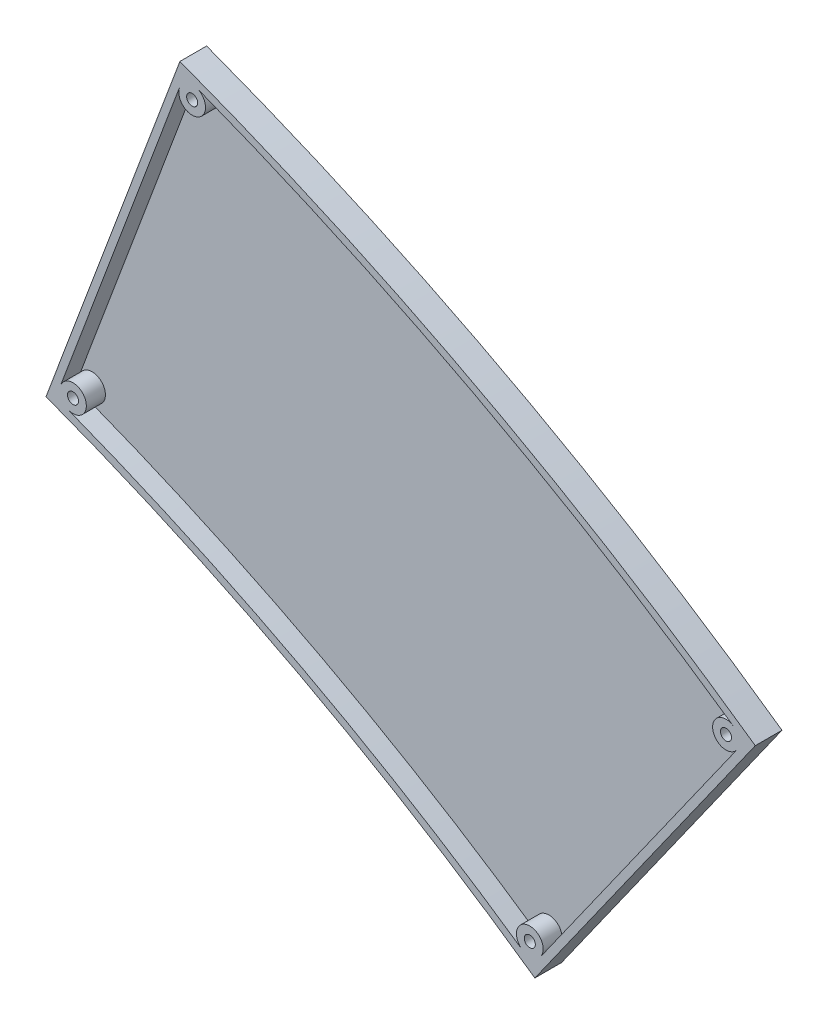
ISO-10303-21;
HEADER;
FILE_DESCRIPTION(('STEP AP214'),'2;1');
FILE_NAME('part.step','',(''),(''),'','','');
FILE_SCHEMA(('AUTOMOTIVE_DESIGN { 1 0 10303 214 1 1 1 1 }'));
ENDSEC;
DATA;
#1=APPLICATION_CONTEXT('core data for automotive mechanical design processes');
#2=APPLICATION_PROTOCOL_DEFINITION('international standard','automotive_design',2000,#1);
#3=PRODUCT_CONTEXT('',#1,'mechanical');
#4=PRODUCT('Part','Part','',(#3));
#5=PRODUCT_RELATED_PRODUCT_CATEGORY('part','',(#4));
#6=PRODUCT_DEFINITION_FORMATION('','',#4);
#7=PRODUCT_DEFINITION_CONTEXT('part definition',#1,'design');
#8=PRODUCT_DEFINITION('design','',#6,#7);
#9=PRODUCT_DEFINITION_SHAPE('','',#8);
#10=(LENGTH_UNIT() NAMED_UNIT(*) SI_UNIT(.MILLI.,.METRE.));
#11=(NAMED_UNIT(*) PLANE_ANGLE_UNIT() SI_UNIT($,.RADIAN.));
#12=(NAMED_UNIT(*) SI_UNIT($,.STERADIAN.) SOLID_ANGLE_UNIT());
#13=UNCERTAINTY_MEASURE_WITH_UNIT(LENGTH_MEASURE(1.E-05),#10,'distance_accuracy_value','');
#14=(GEOMETRIC_REPRESENTATION_CONTEXT(3) GLOBAL_UNCERTAINTY_ASSIGNED_CONTEXT((#13)) GLOBAL_UNIT_ASSIGNED_CONTEXT((#10,
#11,#12)) REPRESENTATION_CONTEXT('',''));
#15=CARTESIAN_POINT('',(0.,0.,0.));
#16=DIRECTION('',(0.,0.,1.));
#17=DIRECTION('',(1.,0.,0.));
#18=AXIS2_PLACEMENT_3D('',#15,#16,#17);
#19=CARTESIAN_POINT('',(0.,0.,0.));
#20=DIRECTION('',(0.,0.,1.));
#21=DIRECTION('',(1.,0.,0.));
#22=AXIS2_PLACEMENT_3D('',#19,#20,#21);
#23=PLANE('',#22);
#24=DIRECTION('',(-0.350968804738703,-0.936387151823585,0.));
#25=VECTOR('',#24,1.);
#26=CARTESIAN_POINT('',(235.267029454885,621.995518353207,0.));
#27=LINE('',#26,#25);
#28=CARTESIAN_POINT('',(233.328651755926,616.823913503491,0.));
#29=VERTEX_POINT('',#28);
#30=CARTESIAN_POINT('',(202.091172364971,533.482106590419,0.));
#31=VERTEX_POINT('',#30);
#32=EDGE_CURVE('E178',#29,#31,#27,.T.);
#33=ORIENTED_EDGE('',*,*,#32,.T.);
#34=CARTESIAN_POINT('',(205.368527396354,532.253715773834,0.));
#35=DIRECTION('',(0.,0.,1.));
#36=DIRECTION('',(1.,0.,0.));
#37=AXIS2_PLACEMENT_3D('',#34,#35,#36);
#38=CIRCLE('',#37,3.49999999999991);
#39=CARTESIAN_POINT('',(204.108597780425,528.988355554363,0.));
#40=VERTEX_POINT('',#39);
#41=EDGE_CURVE('E93',#40,#31,#38,.T.);
#42=ORIENTED_EDGE('',*,*,#41,.F.);
#43=CARTESIAN_POINT('',(1.36002320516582E-12,3.44169137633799E-12,0.));
#44=DIRECTION('',(0.,0.,1.));
#45=DIRECTION('',(1.,0.,0.));
#46=AXIS2_PLACEMENT_3D('',#43,#44,#45);
#47=CIRCLE('',#46,566.999999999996);
#48=CARTESIAN_POINT('',(323.09941622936,465.935368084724,0.));
#49=VERTEX_POINT('',#48);
#50=EDGE_CURVE('E235',#40,#49,#47,.F.);
#51=ORIENTED_EDGE('',*,*,#50,.T.);
#52=CARTESIAN_POINT('',(325.093857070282,468.81151233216,0.));
#53=DIRECTION('',(0.,0.,1.));
#54=DIRECTION('',(1.,0.,0.));
#55=AXIS2_PLACEMENT_3D('',#52,#53,#54);
#56=CIRCLE('',#55,3.50000000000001);
#57=CARTESIAN_POINT('',(327.950639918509,466.789436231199,0.));
#58=VERTEX_POINT('',#57);
#59=EDGE_CURVE('E202',#58,#49,#56,.T.);
#60=ORIENTED_EDGE('',*,*,#59,.F.);
#61=DIRECTION('',(0.577736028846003,0.816223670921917,0.));
#62=VECTOR('',#61,1.);
#63=CARTESIAN_POINT('',(324.788408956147,462.321846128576,0.));
#64=LINE('',#63,#62);
#65=CARTESIAN_POINT('',(379.371213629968,539.436263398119,0.));
#66=VERTEX_POINT('',#65);
#67=EDGE_CURVE('E221',#58,#66,#64,.T.);
#68=ORIENTED_EDGE('',*,*,#67,.T.);
#69=CARTESIAN_POINT('',(376.514430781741,541.45833949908,0.));
#70=DIRECTION('',(0.,0.,1.));
#71=DIRECTION('',(1.,0.,0.));
#72=AXIS2_PLACEMENT_3D('',#69,#70,#71);
#73=CIRCLE('',#72,3.50000000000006);
#74=CARTESIAN_POINT('',(378.512611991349,544.331886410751,0.));
#75=VERTEX_POINT('',#74);
#76=EDGE_CURVE('E199',#75,#66,#73,.T.);
#77=ORIENTED_EDGE('',*,*,#76,.F.);
#78=CARTESIAN_POINT('',(4.05231403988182E-12,7.21644966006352E-12,0.));
#79=DIRECTION('',(0.,0.,1.));
#80=DIRECTION('',(1.,0.,0.));
#81=AXIS2_PLACEMENT_3D('',#78,#79,#80);
#82=CIRCLE('',#81,662.999999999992);
#83=CARTESIAN_POINT('',(237.861686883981,618.86251939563,0.));
#84=VERTEX_POINT('',#83);
#85=EDGE_CURVE('E219',#75,#84,#82,.T.);
#86=ORIENTED_EDGE('',*,*,#85,.T.);
#87=CARTESIAN_POINT('',(236.606006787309,615.595522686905,0.));
#88=DIRECTION('',(0.,0.,1.));
#89=DIRECTION('',(1.,0.,0.));
#90=AXIS2_PLACEMENT_3D('',#87,#88,#89);
#91=CIRCLE('',#90,3.49999999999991);
#92=EDGE_CURVE('E186',#29,#84,#91,.T.);
#93=ORIENTED_EDGE('',*,*,#92,.F.);
#94=EDGE_LOOP('',(#33,#42,#51,#60,#68,#77,#86,#93));
#95=FACE_BOUND('',#94,.T.);
#96=ADVANCED_FACE('F68',(#95),#23,.T.);
#97=CARTESIAN_POINT('',(4.05231403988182E-12,7.21644966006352E-12,5.));
#98=DIRECTION('',(0.,0.,-1.));
#99=DIRECTION('',(-1.,0.,0.));
#100=AXIS2_PLACEMENT_3D('',#97,#98,#99);
#101=CYLINDRICAL_SURFACE('',#100,662.999999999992);
#102=CARTESIAN_POINT('',(4.05231403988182E-12,7.21644966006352E-12,5.));
#103=DIRECTION('',(0.,0.,1.));
#104=DIRECTION('',(1.,0.,0.));
#105=AXIS2_PLACEMENT_3D('',#102,#103,#104);
#106=CIRCLE('',#105,662.999999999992);
#107=CARTESIAN_POINT('',(378.512611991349,544.331886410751,5.));
#108=VERTEX_POINT('',#107);
#109=CARTESIAN_POINT('',(237.861686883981,618.86251939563,5.));
#110=VERTEX_POINT('',#109);
#111=EDGE_CURVE('E173',#108,#110,#106,.T.);
#112=ORIENTED_EDGE('',*,*,#111,.T.);
#113=DIRECTION('',(0.,0.,-1.));
#114=VECTOR('',#113,1.);
#115=CARTESIAN_POINT('',(237.861686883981,618.86251939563,5.));
#116=LINE('',#115,#114);
#117=EDGE_CURVE('E182',#110,#84,#116,.T.);
#118=ORIENTED_EDGE('',*,*,#117,.T.);
#119=ORIENTED_EDGE('',*,*,#85,.F.);
#120=DIRECTION('',(0.,0.,-1.));
#121=VECTOR('',#120,1.);
#122=CARTESIAN_POINT('',(378.512611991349,544.331886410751,5.));
#123=LINE('',#122,#121);
#124=EDGE_CURVE('E189',#108,#75,#123,.T.);
#125=ORIENTED_EDGE('',*,*,#124,.F.);
#126=EDGE_LOOP('',(#112,#118,#119,#125));
#127=FACE_BOUND('',#126,.T.);
#128=ADVANCED_FACE('F298',(#127),#101,.F.);
#129=CARTESIAN_POINT('',(235.267029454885,621.995518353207,5.));
#130=DIRECTION('',(0.936387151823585,-0.350968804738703,0.));
#131=DIRECTION('',(0.350968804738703,0.936387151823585,0.));
#132=AXIS2_PLACEMENT_3D('',#129,#130,#131);
#133=PLANE('',#132);
#134=DIRECTION('',(0.,0.,-1.));
#135=VECTOR('',#134,1.);
#136=CARTESIAN_POINT('',(202.091172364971,533.482106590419,5.));
#137=LINE('',#136,#135);
#138=CARTESIAN_POINT('',(202.091172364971,533.482106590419,5.));
#139=VERTEX_POINT('',#138);
#140=EDGE_CURVE('E86',#139,#31,#137,.T.);
#141=ORIENTED_EDGE('',*,*,#140,.T.);
#142=ORIENTED_EDGE('',*,*,#32,.F.);
#143=DIRECTION('',(0.,0.,-1.));
#144=VECTOR('',#143,1.);
#145=CARTESIAN_POINT('',(233.328651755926,616.823913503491,5.));
#146=LINE('',#145,#144);
#147=CARTESIAN_POINT('',(233.328651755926,616.823913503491,5.));
#148=VERTEX_POINT('',#147);
#149=EDGE_CURVE('E176',#148,#29,#146,.T.);
#150=ORIENTED_EDGE('',*,*,#149,.F.);
#151=DIRECTION('',(-0.350968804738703,-0.936387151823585,0.));
#152=VECTOR('',#151,1.);
#153=CARTESIAN_POINT('',(235.267029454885,621.995518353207,5.));
#154=LINE('',#153,#152);
#155=EDGE_CURVE('E160',#148,#139,#154,.T.);
#156=ORIENTED_EDGE('',*,*,#155,.T.);
#157=EDGE_LOOP('',(#141,#142,#150,#156));
#158=FACE_BOUND('',#157,.T.);
#159=ADVANCED_FACE('F177',(#158),#133,.T.);
#160=CARTESIAN_POINT('',(1.36002320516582E-12,3.44169137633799E-12,5.));
#161=DIRECTION('',(0.,0.,-1.));
#162=DIRECTION('',(-1.,0.,0.));
#163=AXIS2_PLACEMENT_3D('',#160,#161,#162);
#164=CYLINDRICAL_SURFACE('',#163,566.999999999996);
#165=DIRECTION('',(0.,0.,-1.));
#166=VECTOR('',#165,1.);
#167=CARTESIAN_POINT('',(204.108597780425,528.988355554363,5.));
#168=LINE('',#167,#166);
#169=CARTESIAN_POINT('',(204.108597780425,528.988355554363,5.));
#170=VERTEX_POINT('',#169);
#171=EDGE_CURVE('E369',#170,#40,#168,.T.);
#172=ORIENTED_EDGE('',*,*,#171,.F.);
#173=CARTESIAN_POINT('',(1.36002320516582E-12,3.44169137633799E-12,5.));
#174=DIRECTION('',(0.,0.,1.));
#175=DIRECTION('',(1.,0.,0.));
#176=AXIS2_PLACEMENT_3D('',#173,#174,#175);
#177=CIRCLE('',#176,566.999999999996);
#178=CARTESIAN_POINT('',(323.09941622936,465.935368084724,5.));
#179=VERTEX_POINT('',#178);
#180=EDGE_CURVE('E172',#170,#179,#177,.F.);
#181=ORIENTED_EDGE('',*,*,#180,.T.);
#182=DIRECTION('',(0.,0.,-1.));
#183=VECTOR('',#182,1.);
#184=CARTESIAN_POINT('',(323.09941622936,465.935368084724,5.));
#185=LINE('',#184,#183);
#186=EDGE_CURVE('E209',#179,#49,#185,.T.);
#187=ORIENTED_EDGE('',*,*,#186,.T.);
#188=ORIENTED_EDGE('',*,*,#50,.F.);
#189=EDGE_LOOP('',(#172,#181,#187,#188));
#190=FACE_BOUND('',#189,.T.);
#191=ADVANCED_FACE('F319',(#190),#164,.T.);
#192=CARTESIAN_POINT('',(324.788408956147,462.321846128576,5.));
#193=DIRECTION('',(-0.816223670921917,0.577736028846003,0.));
#194=DIRECTION('',(-0.577736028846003,-0.816223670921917,0.));
#195=AXIS2_PLACEMENT_3D('',#192,#193,#194);
#196=PLANE('',#195);
#197=DIRECTION('',(0.,0.,-1.));
#198=VECTOR('',#197,1.);
#199=CARTESIAN_POINT('',(379.371213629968,539.436263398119,5.));
#200=LINE('',#199,#198);
#201=CARTESIAN_POINT('',(379.371213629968,539.436263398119,5.));
#202=VERTEX_POINT('',#201);
#203=EDGE_CURVE('E194',#202,#66,#200,.T.);
#204=ORIENTED_EDGE('',*,*,#203,.T.);
#205=ORIENTED_EDGE('',*,*,#67,.F.);
#206=DIRECTION('',(0.,0.,-1.));
#207=VECTOR('',#206,1.);
#208=CARTESIAN_POINT('',(327.950639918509,466.789436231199,5.));
#209=LINE('',#208,#207);
#210=CARTESIAN_POINT('',(327.950639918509,466.789436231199,5.));
#211=VERTEX_POINT('',#210);
#212=EDGE_CURVE('E216',#211,#58,#209,.T.);
#213=ORIENTED_EDGE('',*,*,#212,.F.);
#214=DIRECTION('',(0.577736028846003,0.816223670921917,0.));
#215=VECTOR('',#214,1.);
#216=CARTESIAN_POINT('',(324.788408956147,462.321846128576,5.));
#217=LINE('',#216,#215);
#218=EDGE_CURVE('E225',#211,#202,#217,.T.);
#219=ORIENTED_EDGE('',*,*,#218,.T.);
#220=EDGE_LOOP('',(#204,#205,#213,#219));
#221=FACE_BOUND('',#220,.T.);
#222=ADVANCED_FACE('F312',(#221),#196,.T.);
#223=CARTESIAN_POINT('',(0.,0.,-2.));
#224=DIRECTION('',(0.,0.,1.));
#225=DIRECTION('',(1.,0.,0.));
#226=AXIS2_PLACEMENT_3D('',#223,#224,#225);
#227=CYLINDRICAL_SURFACE('',#226,565.);
#228=DIRECTION('',(0.,0.,1.));
#229=VECTOR('',#228,1.);
#230=CARTESIAN_POINT('',(326.420856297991,461.166374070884,-2.));
#231=LINE('',#230,#229);
#232=CARTESIAN_POINT('',(326.420856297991,461.166374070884,-2.));
#233=VERTEX_POINT('',#232);
#234=CARTESIAN_POINT('',(326.420856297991,461.166374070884,5.));
#235=VERTEX_POINT('',#234);
#236=EDGE_CURVE('E72',#233,#235,#231,.T.);
#237=ORIENTED_EDGE('',*,*,#236,.T.);
#238=CARTESIAN_POINT('',(1.36002320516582E-12,3.44169137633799E-12,5.));
#239=DIRECTION('',(0.,0.,-1.));
#240=DIRECTION('',(-1.,0.,0.));
#241=AXIS2_PLACEMENT_3D('',#238,#239,#240);
#242=CIRCLE('',#241,564.999999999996);
#243=CARTESIAN_POINT('',(198.297374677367,529.058740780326,5.));
#244=VERTEX_POINT('',#243);
#245=EDGE_CURVE('E248',#244,#235,#242,.T.);
#246=ORIENTED_EDGE('',*,*,#245,.F.);
#247=DIRECTION('',(0.,0.,1.));
#248=VECTOR('',#247,1.);
#249=CARTESIAN_POINT('',(198.297374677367,529.058740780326,-2.));
#250=LINE('',#249,#248);
#251=CARTESIAN_POINT('',(198.297374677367,529.058740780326,-2.));
#252=VERTEX_POINT('',#251);
#253=EDGE_CURVE('E12',#252,#244,#250,.T.);
#254=ORIENTED_EDGE('',*,*,#253,.F.);
#255=CARTESIAN_POINT('',(0.,0.,-2.));
#256=DIRECTION('',(0.,0.,-1.));
#257=DIRECTION('',(1.,0.,0.));
#258=AXIS2_PLACEMENT_3D('',#255,#256,#257);
#259=CIRCLE('',#258,565.);
#260=EDGE_CURVE('E256',#252,#233,#259,.T.);
#261=ORIENTED_EDGE('',*,*,#260,.T.);
#262=EDGE_LOOP('',(#237,#246,#254,#261));
#263=FACE_BOUND('',#262,.T.);
#264=ADVANCED_FACE('F70',(#263),#227,.F.);
#265=CARTESIAN_POINT('',(198.297374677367,529.058740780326,-2.));
#266=DIRECTION('',(-0.936387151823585,0.350968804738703,0.));
#267=DIRECTION('',(-0.350968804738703,-0.936387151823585,0.));
#268=AXIS2_PLACEMENT_3D('',#265,#266,#267);
#269=PLANE('',#268);
#270=ORIENTED_EDGE('',*,*,#253,.T.);
#271=DIRECTION('',(-0.350968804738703,-0.936387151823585,0.));
#272=VECTOR('',#271,1.);
#273=CARTESIAN_POINT('',(233.394255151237,622.697455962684,5.));
#274=LINE('',#273,#272);
#275=CARTESIAN_POINT('',(233.394255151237,622.697455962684,5.));
#276=VERTEX_POINT('',#275);
#277=EDGE_CURVE('E244',#276,#244,#274,.T.);
#278=ORIENTED_EDGE('',*,*,#277,.F.);
#279=DIRECTION('',(0.,0.,1.));
#280=VECTOR('',#279,1.);
#281=CARTESIAN_POINT('',(233.394255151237,622.697455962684,-2.));
#282=LINE('',#281,#280);
#283=CARTESIAN_POINT('',(233.394255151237,622.697455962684,-2.));
#284=VERTEX_POINT('',#283);
#285=EDGE_CURVE('E78',#284,#276,#282,.T.);
#286=ORIENTED_EDGE('',*,*,#285,.F.);
#287=DIRECTION('',(-0.350968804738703,-0.936387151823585,0.));
#288=VECTOR('',#287,1.);
#289=CARTESIAN_POINT('',(198.297374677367,529.058740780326,-2.));
#290=LINE('',#289,#288);
#291=EDGE_CURVE('E268',#284,#252,#290,.T.);
#292=ORIENTED_EDGE('',*,*,#291,.T.);
#293=EDGE_LOOP('',(#270,#278,#286,#292));
#294=FACE_BOUND('',#293,.T.);
#295=ADVANCED_FACE('F294',(#294),#269,.T.);
#296=CARTESIAN_POINT('',(0.,0.,-2.));
#297=DIRECTION('',(0.,0.,1.));
#298=DIRECTION('',(1.,0.,0.));
#299=AXIS2_PLACEMENT_3D('',#296,#297,#298);
#300=CYLINDRICAL_SURFACE('',#299,665.);
#301=ORIENTED_EDGE('',*,*,#285,.T.);
#302=CARTESIAN_POINT('',(4.05231403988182E-12,7.21644966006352E-12,5.));
#303=DIRECTION('',(0.,0.,1.));
#304=DIRECTION('',(1.,0.,0.));
#305=AXIS2_PLACEMENT_3D('',#302,#303,#304);
#306=CIRCLE('',#305,664.999999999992);
#307=CARTESIAN_POINT('',(384.194459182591,542.788741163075,5.));
#308=VERTEX_POINT('',#307);
#309=EDGE_CURVE('E229',#308,#276,#306,.T.);
#310=ORIENTED_EDGE('',*,*,#309,.F.);
#311=DIRECTION('',(0.,0.,1.));
#312=VECTOR('',#311,1.);
#313=CARTESIAN_POINT('',(384.194459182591,542.788741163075,-2.));
#314=LINE('',#313,#312);
#315=CARTESIAN_POINT('',(384.194459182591,542.788741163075,-2.));
#316=VERTEX_POINT('',#315);
#317=EDGE_CURVE('E273',#316,#308,#314,.T.);
#318=ORIENTED_EDGE('',*,*,#317,.F.);
#319=CARTESIAN_POINT('',(0.,0.,-2.));
#320=DIRECTION('',(0.,0.,1.));
#321=DIRECTION('',(1.,0.,0.));
#322=AXIS2_PLACEMENT_3D('',#319,#320,#321);
#323=CIRCLE('',#322,665.);
#324=EDGE_CURVE('E264',#316,#284,#323,.T.);
#325=ORIENTED_EDGE('',*,*,#324,.T.);
#326=EDGE_LOOP('',(#301,#310,#318,#325));
#327=FACE_BOUND('',#326,.T.);
#328=ADVANCED_FACE('F287',(#327),#300,.T.);
#329=CARTESIAN_POINT('',(326.420856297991,461.166374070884,-2.));
#330=DIRECTION('',(0.816223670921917,-0.577736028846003,0.));
#331=DIRECTION('',(0.577736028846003,0.816223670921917,0.));
#332=AXIS2_PLACEMENT_3D('',#329,#330,#331);
#333=PLANE('',#332);
#334=ORIENTED_EDGE('',*,*,#317,.T.);
#335=DIRECTION('',(0.577736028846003,0.816223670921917,0.));
#336=VECTOR('',#335,1.);
#337=CARTESIAN_POINT('',(326.420856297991,461.166374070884,5.));
#338=LINE('',#337,#336);
#339=EDGE_CURVE('E252',#235,#308,#338,.T.);
#340=ORIENTED_EDGE('',*,*,#339,.F.);
#341=ORIENTED_EDGE('',*,*,#236,.F.);
#342=DIRECTION('',(0.577736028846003,0.816223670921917,0.));
#343=VECTOR('',#342,1.);
#344=CARTESIAN_POINT('',(326.420856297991,461.166374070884,-2.));
#345=LINE('',#344,#343);
#346=EDGE_CURVE('E260',#233,#316,#345,.T.);
#347=ORIENTED_EDGE('',*,*,#346,.T.);
#348=EDGE_LOOP('',(#334,#340,#341,#347));
#349=FACE_BOUND('',#348,.T.);
#350=ADVANCED_FACE('F284',(#349),#333,.T.);
#351=CARTESIAN_POINT('',(0.,0.,-2.));
#352=DIRECTION('',(0.,0.,1.));
#353=DIRECTION('',(1.,0.,0.));
#354=AXIS2_PLACEMENT_3D('',#351,#352,#353);
#355=PLANE('',#354);
#356=CARTESIAN_POINT('',(236.606006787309,615.595522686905,-2.));
#357=DIRECTION('',(0.,0.,1.));
#358=DIRECTION('',(1.,0.,0.));
#359=AXIS2_PLACEMENT_3D('',#356,#357,#358);
#360=CIRCLE('',#359,3.49999999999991);
#361=CARTESIAN_POINT('',(240.106006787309,615.595522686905,-2.));
#362=VERTEX_POINT('',#361);
#363=EDGE_CURVE('E370',#362,#362,#360,.T.);
#364=ORIENTED_EDGE('',*,*,#363,.T.);
#365=EDGE_LOOP('',(#364));
#366=FACE_BOUND('',#365,.T.);
#367=CARTESIAN_POINT('',(205.368527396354,532.253715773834,-2.));
#368=DIRECTION('',(0.,0.,1.));
#369=DIRECTION('',(1.,0.,0.));
#370=AXIS2_PLACEMENT_3D('',#367,#368,#369);
#371=CIRCLE('',#370,3.49999999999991);
#372=CARTESIAN_POINT('',(208.868527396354,532.253715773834,-2.));
#373=VERTEX_POINT('',#372);
#374=EDGE_CURVE('E374',#373,#373,#371,.T.);
#375=ORIENTED_EDGE('',*,*,#374,.T.);
#376=EDGE_LOOP('',(#375));
#377=FACE_BOUND('',#376,.T.);
#378=CARTESIAN_POINT('',(325.093857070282,468.81151233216,-2.));
#379=DIRECTION('',(0.,0.,1.));
#380=DIRECTION('',(1.,0.,0.));
#381=AXIS2_PLACEMENT_3D('',#378,#379,#380);
#382=CIRCLE('',#381,3.49999999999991);
#383=CARTESIAN_POINT('',(328.593857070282,468.81151233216,-2.));
#384=VERTEX_POINT('',#383);
#385=EDGE_CURVE('E382',#384,#384,#382,.T.);
#386=ORIENTED_EDGE('',*,*,#385,.T.);
#387=EDGE_LOOP('',(#386));
#388=FACE_BOUND('',#387,.T.);
#389=CARTESIAN_POINT('',(376.514430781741,541.45833949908,-2.));
#390=DIRECTION('',(0.,0.,1.));
#391=DIRECTION('',(1.,0.,0.));
#392=AXIS2_PLACEMENT_3D('',#389,#390,#391);
#393=CIRCLE('',#392,3.49999999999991);
#394=CARTESIAN_POINT('',(380.014430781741,541.45833949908,-2.));
#395=VERTEX_POINT('',#394);
#396=EDGE_CURVE('E390',#395,#395,#393,.T.);
#397=ORIENTED_EDGE('',*,*,#396,.T.);
#398=EDGE_LOOP('',(#397));
#399=FACE_BOUND('',#398,.T.);
#400=ORIENTED_EDGE('',*,*,#260,.F.);
#401=ORIENTED_EDGE('',*,*,#291,.F.);
#402=ORIENTED_EDGE('',*,*,#324,.F.);
#403=ORIENTED_EDGE('',*,*,#346,.F.);
#404=EDGE_LOOP('',(#400,#401,#402,#403));
#405=FACE_BOUND('',#404,.T.);
#406=ADVANCED_FACE('F286',(#366,#377,#388,#399,#405),#355,.F.);
#407=CARTESIAN_POINT('',(4.05231403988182E-12,7.21644966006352E-12,5.));
#408=DIRECTION('',(0.,0.,1.));
#409=DIRECTION('',(1.,0.,0.));
#410=AXIS2_PLACEMENT_3D('',#407,#408,#409);
#411=PLANE('',#410);
#412=CARTESIAN_POINT('',(376.514430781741,541.45833949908,5.));
#413=DIRECTION('',(0.,0.,-1.));
#414=DIRECTION('',(-1.,0.,0.));
#415=AXIS2_PLACEMENT_3D('',#412,#413,#414);
#416=CIRCLE('',#415,1.45000000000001);
#417=CARTESIAN_POINT('',(375.064430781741,541.45833949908,5.));
#418=VERTEX_POINT('',#417);
#419=EDGE_CURVE('E344',#418,#418,#416,.T.);
#420=ORIENTED_EDGE('',*,*,#419,.T.);
#421=EDGE_LOOP('',(#420));
#422=FACE_BOUND('',#421,.T.);
#423=CARTESIAN_POINT('',(325.093857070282,468.81151233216,5.));
#424=DIRECTION('',(0.,0.,-1.));
#425=DIRECTION('',(-1.,0.,0.));
#426=AXIS2_PLACEMENT_3D('',#423,#424,#425);
#427=CIRCLE('',#426,1.45000000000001);
#428=CARTESIAN_POINT('',(323.643857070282,468.81151233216,5.));
#429=VERTEX_POINT('',#428);
#430=EDGE_CURVE('E348',#429,#429,#427,.T.);
#431=ORIENTED_EDGE('',*,*,#430,.T.);
#432=EDGE_LOOP('',(#431));
#433=FACE_BOUND('',#432,.T.);
#434=CARTESIAN_POINT('',(205.368527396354,532.253715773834,5.));
#435=DIRECTION('',(0.,0.,-1.));
#436=DIRECTION('',(-1.,0.,0.));
#437=AXIS2_PLACEMENT_3D('',#434,#435,#436);
#438=CIRCLE('',#437,1.45000000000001);
#439=CARTESIAN_POINT('',(203.918527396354,532.253715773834,5.));
#440=VERTEX_POINT('',#439);
#441=EDGE_CURVE('E352',#440,#440,#438,.T.);
#442=ORIENTED_EDGE('',*,*,#441,.T.);
#443=EDGE_LOOP('',(#442));
#444=FACE_BOUND('',#443,.T.);
#445=CARTESIAN_POINT('',(236.606006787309,615.595522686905,5.));
#446=DIRECTION('',(0.,0.,-1.));
#447=DIRECTION('',(-1.,0.,0.));
#448=AXIS2_PLACEMENT_3D('',#445,#446,#447);
#449=CIRCLE('',#448,1.45000000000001);
#450=CARTESIAN_POINT('',(235.156006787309,615.595522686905,5.));
#451=VERTEX_POINT('',#450);
#452=EDGE_CURVE('E355',#451,#451,#449,.T.);
#453=ORIENTED_EDGE('',*,*,#452,.T.);
#454=EDGE_LOOP('',(#453));
#455=FACE_BOUND('',#454,.T.);
#456=ORIENTED_EDGE('',*,*,#180,.F.);
#457=CARTESIAN_POINT('',(205.368527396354,532.253715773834,5.));
#458=DIRECTION('',(0.,0.,1.));
#459=DIRECTION('',(1.,0.,0.));
#460=AXIS2_PLACEMENT_3D('',#457,#458,#459);
#461=CIRCLE('',#460,3.49999999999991);
#462=EDGE_CURVE('E170',#170,#139,#461,.T.);
#463=ORIENTED_EDGE('',*,*,#462,.T.);
#464=ORIENTED_EDGE('',*,*,#155,.F.);
#465=CARTESIAN_POINT('',(236.606006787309,615.595522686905,5.));
#466=DIRECTION('',(0.,0.,1.));
#467=DIRECTION('',(1.,0.,0.));
#468=AXIS2_PLACEMENT_3D('',#465,#466,#467);
#469=CIRCLE('',#468,3.49999999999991);
#470=EDGE_CURVE('E167',#148,#110,#469,.T.);
#471=ORIENTED_EDGE('',*,*,#470,.T.);
#472=ORIENTED_EDGE('',*,*,#111,.F.);
#473=CARTESIAN_POINT('',(376.514430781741,541.45833949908,5.));
#474=DIRECTION('',(0.,0.,1.));
#475=DIRECTION('',(1.,0.,0.));
#476=AXIS2_PLACEMENT_3D('',#473,#474,#475);
#477=CIRCLE('',#476,3.50000000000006);
#478=EDGE_CURVE('E198',#108,#202,#477,.T.);
#479=ORIENTED_EDGE('',*,*,#478,.T.);
#480=ORIENTED_EDGE('',*,*,#218,.F.);
#481=CARTESIAN_POINT('',(325.093857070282,468.81151233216,5.));
#482=DIRECTION('',(0.,0.,1.));
#483=DIRECTION('',(1.,0.,0.));
#484=AXIS2_PLACEMENT_3D('',#481,#482,#483);
#485=CIRCLE('',#484,3.50000000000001);
#486=EDGE_CURVE('E205',#211,#179,#485,.T.);
#487=ORIENTED_EDGE('',*,*,#486,.T.);
#488=EDGE_LOOP('',(#456,#463,#464,#471,#472,#479,#480,#487));
#489=FACE_BOUND('',#488,.T.);
#490=ORIENTED_EDGE('',*,*,#309,.T.);
#491=ORIENTED_EDGE('',*,*,#277,.T.);
#492=ORIENTED_EDGE('',*,*,#245,.T.);
#493=ORIENTED_EDGE('',*,*,#339,.T.);
#494=EDGE_LOOP('',(#490,#491,#492,#493));
#495=FACE_BOUND('',#494,.T.);
#496=ADVANCED_FACE('F163',(#422,#433,#444,#455,#489,#495),#411,.T.);
#497=CARTESIAN_POINT('',(325.093857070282,468.81151233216,5.));
#498=DIRECTION('',(0.,0.,-1.));
#499=DIRECTION('',(-1.,0.,0.));
#500=AXIS2_PLACEMENT_3D('',#497,#498,#499);
#501=CYLINDRICAL_SURFACE('',#500,3.50000000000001);
#502=ORIENTED_EDGE('',*,*,#59,.T.);
#503=ORIENTED_EDGE('',*,*,#186,.F.);
#504=ORIENTED_EDGE('',*,*,#486,.F.);
#505=ORIENTED_EDGE('',*,*,#212,.T.);
#506=EDGE_LOOP('',(#502,#503,#504,#505));
#507=FACE_BOUND('',#506,.T.);
#508=ADVANCED_FACE('F328',(#507),#501,.T.);
#509=CARTESIAN_POINT('',(376.514430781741,541.45833949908,5.));
#510=DIRECTION('',(0.,0.,-1.));
#511=DIRECTION('',(-1.,0.,0.));
#512=AXIS2_PLACEMENT_3D('',#509,#510,#511);
#513=CYLINDRICAL_SURFACE('',#512,3.50000000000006);
#514=ORIENTED_EDGE('',*,*,#76,.T.);
#515=ORIENTED_EDGE('',*,*,#203,.F.);
#516=ORIENTED_EDGE('',*,*,#478,.F.);
#517=ORIENTED_EDGE('',*,*,#124,.T.);
#518=EDGE_LOOP('',(#514,#515,#516,#517));
#519=FACE_BOUND('',#518,.T.);
#520=ADVANCED_FACE('F339',(#519),#513,.T.);
#521=CARTESIAN_POINT('',(236.606006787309,615.595522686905,5.));
#522=DIRECTION('',(0.,0.,-1.));
#523=DIRECTION('',(-1.,0.,0.));
#524=AXIS2_PLACEMENT_3D('',#521,#522,#523);
#525=CYLINDRICAL_SURFACE('',#524,3.49999999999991);
#526=ORIENTED_EDGE('',*,*,#92,.T.);
#527=ORIENTED_EDGE('',*,*,#117,.F.);
#528=ORIENTED_EDGE('',*,*,#470,.F.);
#529=ORIENTED_EDGE('',*,*,#149,.T.);
#530=EDGE_LOOP('',(#526,#527,#528,#529));
#531=FACE_BOUND('',#530,.T.);
#532=ADVANCED_FACE('F184',(#531),#525,.T.);
#533=CARTESIAN_POINT('',(205.368527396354,532.253715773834,5.));
#534=DIRECTION('',(0.,0.,-1.));
#535=DIRECTION('',(-1.,0.,0.));
#536=AXIS2_PLACEMENT_3D('',#533,#534,#535);
#537=CYLINDRICAL_SURFACE('',#536,3.49999999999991);
#538=ORIENTED_EDGE('',*,*,#41,.T.);
#539=ORIENTED_EDGE('',*,*,#140,.F.);
#540=ORIENTED_EDGE('',*,*,#462,.F.);
#541=ORIENTED_EDGE('',*,*,#171,.T.);
#542=EDGE_LOOP('',(#538,#539,#540,#541));
#543=FACE_BOUND('',#542,.T.);
#544=ADVANCED_FACE('F419',(#543),#537,.T.);
#545=CARTESIAN_POINT('',(376.514430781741,541.45833949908,-0.5));
#546=DIRECTION('',(0.,0.,-1.));
#547=DIRECTION('',(-1.,0.,0.));
#548=AXIS2_PLACEMENT_3D('',#545,#546,#547);
#549=CYLINDRICAL_SURFACE('',#548,3.49999999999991);
#550=CARTESIAN_POINT('',(376.514430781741,541.45833949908,-0.5));
#551=DIRECTION('',(0.,0.,1.));
#552=DIRECTION('',(1.,0.,0.));
#553=AXIS2_PLACEMENT_3D('',#550,#551,#552);
#554=CIRCLE('',#553,3.49999999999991);
#555=CARTESIAN_POINT('',(380.014430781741,541.45833949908,-0.5));
#556=VERTEX_POINT('',#555);
#557=EDGE_CURVE('E394',#556,#556,#554,.T.);
#558=ORIENTED_EDGE('',*,*,#557,.T.);
#559=EDGE_LOOP('',(#558));
#560=FACE_BOUND('',#559,.T.);
#561=ORIENTED_EDGE('',*,*,#396,.F.);
#562=EDGE_LOOP('',(#561));
#563=FACE_BOUND('',#562,.T.);
#564=ADVANCED_FACE('F421',(#560,#563),#549,.F.);
#565=CARTESIAN_POINT('',(376.514430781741,541.45833949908,-0.5));
#566=DIRECTION('',(0.,0.,1.));
#567=DIRECTION('',(1.,0.,0.));
#568=AXIS2_PLACEMENT_3D('',#565,#566,#567);
#569=PLANE('',#568);
#570=CARTESIAN_POINT('',(376.514430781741,541.45833949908,-0.5));
#571=DIRECTION('',(0.,0.,-1.));
#572=DIRECTION('',(-1.,0.,0.));
#573=AXIS2_PLACEMENT_3D('',#570,#571,#572);
#574=CIRCLE('',#573,1.45000000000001);
#575=CARTESIAN_POINT('',(375.064430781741,541.45833949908,-0.5));
#576=VERTEX_POINT('',#575);
#577=EDGE_CURVE('E754',#576,#576,#574,.T.);
#578=ORIENTED_EDGE('',*,*,#577,.F.);
#579=EDGE_LOOP('',(#578));
#580=FACE_BOUND('',#579,.T.);
#581=ORIENTED_EDGE('',*,*,#557,.F.);
#582=EDGE_LOOP('',(#581));
#583=FACE_BOUND('',#582,.T.);
#584=ADVANCED_FACE('F427',(#580,#583),#569,.F.);
#585=CARTESIAN_POINT('',(325.093857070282,468.81151233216,-0.5));
#586=DIRECTION('',(0.,0.,-1.));
#587=DIRECTION('',(-1.,0.,0.));
#588=AXIS2_PLACEMENT_3D('',#585,#586,#587);
#589=CYLINDRICAL_SURFACE('',#588,3.49999999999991);
#590=CARTESIAN_POINT('',(325.093857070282,468.81151233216,-0.5));
#591=DIRECTION('',(0.,0.,1.));
#592=DIRECTION('',(1.,0.,0.));
#593=AXIS2_PLACEMENT_3D('',#590,#591,#592);
#594=CIRCLE('',#593,3.49999999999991);
#595=CARTESIAN_POINT('',(328.593857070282,468.81151233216,-0.5));
#596=VERTEX_POINT('',#595);
#597=EDGE_CURVE('E386',#596,#596,#594,.T.);
#598=ORIENTED_EDGE('',*,*,#597,.T.);
#599=EDGE_LOOP('',(#598));
#600=FACE_BOUND('',#599,.T.);
#601=ORIENTED_EDGE('',*,*,#385,.F.);
#602=EDGE_LOOP('',(#601));
#603=FACE_BOUND('',#602,.T.);
#604=ADVANCED_FACE('F462',(#600,#603),#589,.F.);
#605=CARTESIAN_POINT('',(325.093857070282,468.81151233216,-0.5));
#606=DIRECTION('',(0.,0.,1.));
#607=DIRECTION('',(1.,0.,0.));
#608=AXIS2_PLACEMENT_3D('',#605,#606,#607);
#609=PLANE('',#608);
#610=CARTESIAN_POINT('',(325.093857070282,468.81151233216,-0.5));
#611=DIRECTION('',(0.,0.,-1.));
#612=DIRECTION('',(-1.,0.,0.));
#613=AXIS2_PLACEMENT_3D('',#610,#611,#612);
#614=CIRCLE('',#613,1.45000000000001);
#615=CARTESIAN_POINT('',(323.643857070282,468.81151233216,-0.5));
#616=VERTEX_POINT('',#615);
#617=EDGE_CURVE('E756',#616,#616,#614,.T.);
#618=ORIENTED_EDGE('',*,*,#617,.F.);
#619=EDGE_LOOP('',(#618));
#620=FACE_BOUND('',#619,.T.);
#621=ORIENTED_EDGE('',*,*,#597,.F.);
#622=EDGE_LOOP('',(#621));
#623=FACE_BOUND('',#622,.T.);
#624=ADVANCED_FACE('F472',(#620,#623),#609,.F.);
#625=CARTESIAN_POINT('',(205.368527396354,532.253715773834,-0.5));
#626=DIRECTION('',(0.,0.,-1.));
#627=DIRECTION('',(-1.,0.,0.));
#628=AXIS2_PLACEMENT_3D('',#625,#626,#627);
#629=CYLINDRICAL_SURFACE('',#628,3.49999999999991);
#630=CARTESIAN_POINT('',(205.368527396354,532.253715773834,-0.5));
#631=DIRECTION('',(0.,0.,1.));
#632=DIRECTION('',(1.,0.,0.));
#633=AXIS2_PLACEMENT_3D('',#630,#631,#632);
#634=CIRCLE('',#633,3.49999999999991);
#635=CARTESIAN_POINT('',(208.868527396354,532.253715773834,-0.5));
#636=VERTEX_POINT('',#635);
#637=EDGE_CURVE('E378',#636,#636,#634,.T.);
#638=ORIENTED_EDGE('',*,*,#637,.T.);
#639=EDGE_LOOP('',(#638));
#640=FACE_BOUND('',#639,.T.);
#641=ORIENTED_EDGE('',*,*,#374,.F.);
#642=EDGE_LOOP('',(#641));
#643=FACE_BOUND('',#642,.T.);
#644=ADVANCED_FACE('F483',(#640,#643),#629,.F.);
#645=CARTESIAN_POINT('',(205.368527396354,532.253715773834,-0.5));
#646=DIRECTION('',(0.,0.,1.));
#647=DIRECTION('',(1.,0.,0.));
#648=AXIS2_PLACEMENT_3D('',#645,#646,#647);
#649=PLANE('',#648);
#650=CARTESIAN_POINT('',(205.368527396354,532.253715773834,-0.5));
#651=DIRECTION('',(0.,0.,-1.));
#652=DIRECTION('',(-1.,0.,0.));
#653=AXIS2_PLACEMENT_3D('',#650,#651,#652);
#654=CIRCLE('',#653,1.45000000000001);
#655=CARTESIAN_POINT('',(203.918527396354,532.253715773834,-0.5));
#656=VERTEX_POINT('',#655);
#657=EDGE_CURVE('E766',#656,#656,#654,.T.);
#658=ORIENTED_EDGE('',*,*,#657,.F.);
#659=EDGE_LOOP('',(#658));
#660=FACE_BOUND('',#659,.T.);
#661=ORIENTED_EDGE('',*,*,#637,.F.);
#662=EDGE_LOOP('',(#661));
#663=FACE_BOUND('',#662,.T.);
#664=ADVANCED_FACE('F494',(#660,#663),#649,.F.);
#665=CARTESIAN_POINT('',(236.606006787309,615.595522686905,-0.5));
#666=DIRECTION('',(0.,0.,-1.));
#667=DIRECTION('',(-1.,0.,0.));
#668=AXIS2_PLACEMENT_3D('',#665,#666,#667);
#669=CYLINDRICAL_SURFACE('',#668,3.49999999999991);
#670=CARTESIAN_POINT('',(236.606006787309,615.595522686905,-0.5));
#671=DIRECTION('',(0.,0.,1.));
#672=DIRECTION('',(1.,0.,0.));
#673=AXIS2_PLACEMENT_3D('',#670,#671,#672);
#674=CIRCLE('',#673,3.49999999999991);
#675=CARTESIAN_POINT('',(240.106006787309,615.595522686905,-0.5));
#676=VERTEX_POINT('',#675);
#677=EDGE_CURVE('E365',#676,#676,#674,.T.);
#678=ORIENTED_EDGE('',*,*,#677,.T.);
#679=EDGE_LOOP('',(#678));
#680=FACE_BOUND('',#679,.T.);
#681=ORIENTED_EDGE('',*,*,#363,.F.);
#682=EDGE_LOOP('',(#681));
#683=FACE_BOUND('',#682,.T.);
#684=ADVANCED_FACE('F504',(#680,#683),#669,.F.);
#685=CARTESIAN_POINT('',(236.606006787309,615.595522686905,-0.5));
#686=DIRECTION('',(0.,0.,1.));
#687=DIRECTION('',(1.,0.,0.));
#688=AXIS2_PLACEMENT_3D('',#685,#686,#687);
#689=PLANE('',#688);
#690=CARTESIAN_POINT('',(236.606006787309,615.595522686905,-0.5));
#691=DIRECTION('',(0.,0.,-1.));
#692=DIRECTION('',(-1.,0.,0.));
#693=AXIS2_PLACEMENT_3D('',#690,#691,#692);
#694=CIRCLE('',#693,1.45000000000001);
#695=CARTESIAN_POINT('',(235.156006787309,615.595522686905,-0.5));
#696=VERTEX_POINT('',#695);
#697=EDGE_CURVE('E358',#696,#696,#694,.T.);
#698=ORIENTED_EDGE('',*,*,#697,.F.);
#699=EDGE_LOOP('',(#698));
#700=FACE_BOUND('',#699,.T.);
#701=ORIENTED_EDGE('',*,*,#677,.F.);
#702=EDGE_LOOP('',(#701));
#703=FACE_BOUND('',#702,.T.);
#704=ADVANCED_FACE('F515',(#700,#703),#689,.F.);
#705=CARTESIAN_POINT('',(236.606006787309,615.595522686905,5.));
#706=DIRECTION('',(0.,0.,-1.));
#707=DIRECTION('',(-1.,0.,0.));
#708=AXIS2_PLACEMENT_3D('',#705,#706,#707);
#709=CYLINDRICAL_SURFACE('',#708,1.45000000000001);
#710=ORIENTED_EDGE('',*,*,#452,.F.);
#711=EDGE_LOOP('',(#710));
#712=FACE_BOUND('',#711,.T.);
#713=ORIENTED_EDGE('',*,*,#697,.T.);
#714=EDGE_LOOP('',(#713));
#715=FACE_BOUND('',#714,.T.);
#716=ADVANCED_FACE('F525',(#712,#715),#709,.F.);
#717=CARTESIAN_POINT('',(205.368527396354,532.253715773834,5.));
#718=DIRECTION('',(0.,0.,-1.));
#719=DIRECTION('',(-1.,0.,0.));
#720=AXIS2_PLACEMENT_3D('',#717,#718,#719);
#721=CYLINDRICAL_SURFACE('',#720,1.45000000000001);
#722=ORIENTED_EDGE('',*,*,#441,.F.);
#723=EDGE_LOOP('',(#722));
#724=FACE_BOUND('',#723,.T.);
#725=ORIENTED_EDGE('',*,*,#657,.T.);
#726=EDGE_LOOP('',(#725));
#727=FACE_BOUND('',#726,.T.);
#728=ADVANCED_FACE('F537',(#724,#727),#721,.F.);
#729=CARTESIAN_POINT('',(325.093857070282,468.81151233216,5.));
#730=DIRECTION('',(0.,0.,-1.));
#731=DIRECTION('',(-1.,0.,0.));
#732=AXIS2_PLACEMENT_3D('',#729,#730,#731);
#733=CYLINDRICAL_SURFACE('',#732,1.45000000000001);
#734=ORIENTED_EDGE('',*,*,#430,.F.);
#735=EDGE_LOOP('',(#734));
#736=FACE_BOUND('',#735,.T.);
#737=ORIENTED_EDGE('',*,*,#617,.T.);
#738=EDGE_LOOP('',(#737));
#739=FACE_BOUND('',#738,.T.);
#740=ADVANCED_FACE('F545',(#736,#739),#733,.F.);
#741=CARTESIAN_POINT('',(376.514430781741,541.45833949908,5.));
#742=DIRECTION('',(0.,0.,-1.));
#743=DIRECTION('',(-1.,0.,0.));
#744=AXIS2_PLACEMENT_3D('',#741,#742,#743);
#745=CYLINDRICAL_SURFACE('',#744,1.45000000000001);
#746=ORIENTED_EDGE('',*,*,#419,.F.);
#747=EDGE_LOOP('',(#746));
#748=FACE_BOUND('',#747,.T.);
#749=ORIENTED_EDGE('',*,*,#577,.T.);
#750=EDGE_LOOP('',(#749));
#751=FACE_BOUND('',#750,.T.);
#752=ADVANCED_FACE('F555',(#748,#751),#745,.F.);
#753=CLOSED_SHELL('',(#96,#128,#159,#191,#222,#264,#295,#328,#350,#406,#496,#508,#520,#532,#544,
#564,#584,#604,#624,#644,#664,#684,#704,#716,#728,#740,#752));
#754=MANIFOLD_SOLID_BREP('B2',#753);
#755=ADVANCED_BREP_SHAPE_REPRESENTATION('',(#18,#754),#14);
#756=SHAPE_DEFINITION_REPRESENTATION(#9,#755);
ENDSEC;
END-ISO-10303-21;
